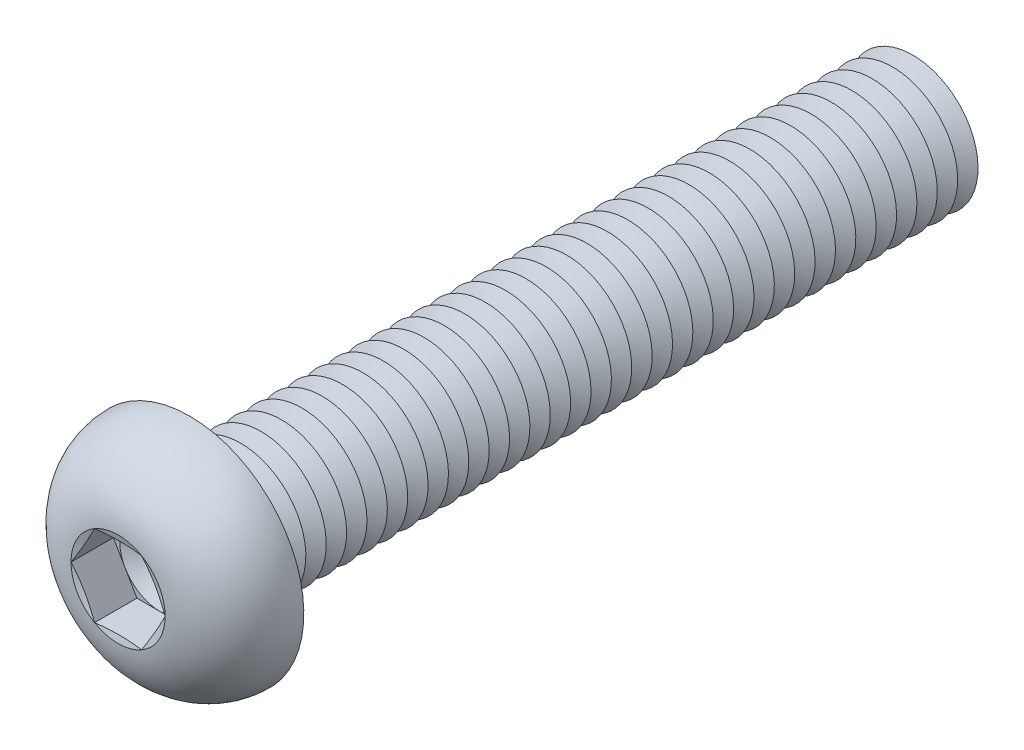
from build123d import *

# Parameters (mm, degrees)
FILLET1_R          = 0.625
LPATTERN1_COUNT    = 36
LPATTERN1_PITCH    = 1.25
CUT_EXTRUDE1_DEPTH = 2.6


with BuildPart() as part:
    # Sketch1 → Revolve1 (revolve)
    with BuildSketch(Plane(origin=(0, 0, 0), x_dir=(0, 0, -1), z_dir=(1, 0, 0))):
        with BuildLine():
            Line((0, 4), (0, 7))
            ThreePointArc((0, 7), (-3.011595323, 5.81154966), (-4.4, 2.88675))
            Line((-4.4, 2.88675), (-4.013248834, 1.443375))
            Line((-4.013248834, 1.443375), (-4.4, 1.443375))
            Line((-4.4, 1.443375), (-4.4, 0))
            Line((-4.4, 0), (45, 0))
            Line((45, 0), (45, 4))
            Line((45, 4), (0, 4))
        make_face()
    revolve(axis=Axis((0, 0, -45), (0, 0, 1)))

    # Fillet1
    fillet1_edges = [part.edges().sort_by_distance(p)[0] for p in [
        (0, -4, 0),
    ]]
    fillet(fillet1_edges, radius=FILLET1_R)

    # Sketch2 → Cut-Revolve1 (revolve, cut)
    with BuildSketch(Plane(origin=(0, 0, 0), x_dir=(0, 0, -1), z_dir=(1, 0, 0))):
        Polygon((44.375, 4), (45.625, 4), (45, 2.917468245), align=None)
    cut_revolve1 = revolve(axis=Axis((0, 0, -45), (0, 0, -1)), mode=Mode.SUBTRACT)

    # LPattern1: Cut-Revolve1 ×36
    with Locations(*[(0, 0, i * LPATTERN1_PITCH) for i in range(1, LPATTERN1_COUNT)]):
        add(cut_revolve1, mode=Mode.SUBTRACT)

    # Sketch3 → Cut-Extrude1 (cut)
    with BuildSketch(Plane.XY.offset(4.4)):
        Polygon((1.443375, 2.499998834), (-1.443375, 2.499998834), (-2.88675, 0), (-1.443375, -2.499998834), (1.443375, -2.499998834), (2.88675, 0), align=None)
    extrude(amount=-CUT_EXTRUDE1_DEPTH, mode=Mode.SUBTRACT)

    # Cut-Extrude2 cone 1 section (on through the dimple's axis) → Cut-Extrude2 (revolve, cut)
    with BuildSketch(Plane(origin=(0, 0, 1.8), x_dir=(0, -1, 0), z_dir=(1, 0, 0))):
        Polygon((0, 0), (2.499998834, 0), (0, 1.443375), align=None)
    revolve(axis=Axis((0, 0, 1.8), (0, 0, -1)), mode=Mode.SUBTRACT)


solid = part.part
